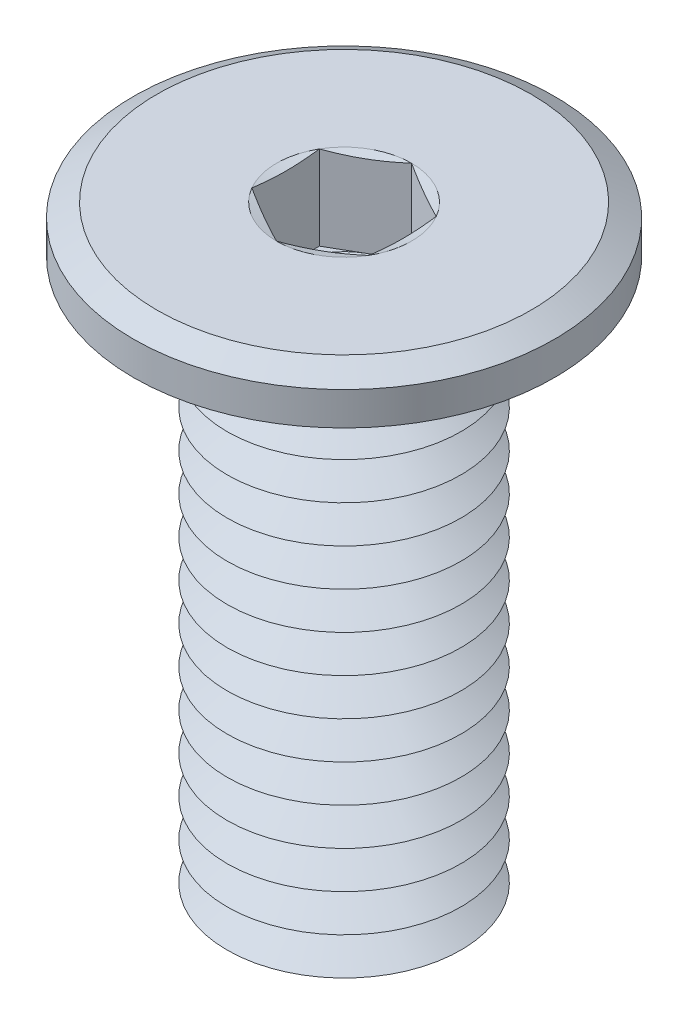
ISO-10303-21;
HEADER;
FILE_DESCRIPTION(('STEP AP214'),'2;1');
FILE_NAME('part.step','',(''),(''),'','','');
FILE_SCHEMA(('AUTOMOTIVE_DESIGN { 1 0 10303 214 1 1 1 1 }'));
ENDSEC;
DATA;
#1=APPLICATION_CONTEXT('core data for automotive mechanical design processes');
#2=APPLICATION_PROTOCOL_DEFINITION('international standard','automotive_design',2000,#1);
#3=PRODUCT_CONTEXT('',#1,'mechanical');
#4=PRODUCT('Part','Part','',(#3));
#5=PRODUCT_RELATED_PRODUCT_CATEGORY('part','',(#4));
#6=PRODUCT_DEFINITION_FORMATION('','',#4);
#7=PRODUCT_DEFINITION_CONTEXT('part definition',#1,'design');
#8=PRODUCT_DEFINITION('design','',#6,#7);
#9=PRODUCT_DEFINITION_SHAPE('','',#8);
#10=(LENGTH_UNIT() NAMED_UNIT(*) SI_UNIT(.MILLI.,.METRE.));
#11=(NAMED_UNIT(*) PLANE_ANGLE_UNIT() SI_UNIT($,.RADIAN.));
#12=(NAMED_UNIT(*) SI_UNIT($,.STERADIAN.) SOLID_ANGLE_UNIT());
#13=UNCERTAINTY_MEASURE_WITH_UNIT(LENGTH_MEASURE(1.E-05),#10,'distance_accuracy_value','');
#14=(GEOMETRIC_REPRESENTATION_CONTEXT(3) GLOBAL_UNCERTAINTY_ASSIGNED_CONTEXT((#13)) GLOBAL_UNIT_ASSIGNED_CONTEXT((#10,
#11,#12)) REPRESENTATION_CONTEXT('',''));
#15=CARTESIAN_POINT('',(0.,0.,0.));
#16=DIRECTION('',(0.,0.,1.));
#17=DIRECTION('',(1.,0.,0.));
#18=AXIS2_PLACEMENT_3D('',#15,#16,#17);
#19=CARTESIAN_POINT('',(0.,-11.8,0.));
#20=DIRECTION('',(0.,-1.,0.));
#21=DIRECTION('',(0.,0.,-1.));
#22=AXIS2_PLACEMENT_3D('',#19,#20,#21);
#23=CONICAL_SURFACE('',#22,2.5,1.0471975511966);
#24=CARTESIAN_POINT('',(0.,-11.4,0.));
#25=DIRECTION('',(0.,1.,0.));
#26=DIRECTION('',(0.,0.,1.));
#27=AXIS2_PLACEMENT_3D('',#24,#25,#26);
#28=CIRCLE('',#27,1.80717967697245);
#29=CARTESIAN_POINT('',(0.,-11.4,1.80717967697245));
#30=VERTEX_POINT('',#29);
#31=EDGE_CURVE('E465',#30,#30,#28,.T.);
#32=ORIENTED_EDGE('',*,*,#31,.F.);
#33=EDGE_LOOP('',(#32));
#34=FACE_BOUND('',#33,.T.);
#35=CARTESIAN_POINT('',(0.,-11.8,0.));
#36=DIRECTION('',(0.,1.,0.));
#37=DIRECTION('',(0.,0.,1.));
#38=AXIS2_PLACEMENT_3D('',#35,#36,#37);
#39=CIRCLE('',#38,2.5);
#40=CARTESIAN_POINT('',(0.,-11.8,2.5));
#41=VERTEX_POINT('',#40);
#42=EDGE_CURVE('E469',#41,#41,#39,.T.);
#43=ORIENTED_EDGE('',*,*,#42,.T.);
#44=EDGE_LOOP('',(#43));
#45=FACE_BOUND('',#44,.T.);
#46=ADVANCED_FACE('F39',(#34,#45),#23,.T.);
#47=CARTESIAN_POINT('',(0.,-11.4,0.));
#48=DIRECTION('',(0.,1.,0.));
#49=DIRECTION('',(0.,0.,1.));
#50=AXIS2_PLACEMENT_3D('',#47,#48,#49);
#51=CONICAL_SURFACE('',#50,1.80717967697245,1.0471975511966);
#52=CARTESIAN_POINT('',(0.,-11.,0.));
#53=DIRECTION('',(0.,1.,0.));
#54=DIRECTION('',(0.,0.,1.));
#55=AXIS2_PLACEMENT_3D('',#52,#53,#54);
#56=CIRCLE('',#55,2.5);
#57=CARTESIAN_POINT('',(0.,-11.,2.5));
#58=VERTEX_POINT('',#57);
#59=EDGE_CURVE('E461',#58,#58,#56,.T.);
#60=ORIENTED_EDGE('',*,*,#59,.F.);
#61=EDGE_LOOP('',(#60));
#62=FACE_BOUND('',#61,.T.);
#63=ORIENTED_EDGE('',*,*,#31,.T.);
#64=EDGE_LOOP('',(#63));
#65=FACE_BOUND('',#64,.T.);
#66=ADVANCED_FACE('F232',(#62,#65),#51,.T.);
#67=CARTESIAN_POINT('',(0.,-13.,0.));
#68=DIRECTION('',(0.,-1.,0.));
#69=DIRECTION('',(0.,0.,-1.));
#70=AXIS2_PLACEMENT_3D('',#67,#68,#69);
#71=PLANE('',#70);
#72=CARTESIAN_POINT('',(0.,-13.,0.));
#73=DIRECTION('',(0.,1.,0.));
#74=DIRECTION('',(0.,0.,1.));
#75=AXIS2_PLACEMENT_3D('',#72,#73,#74);
#76=CIRCLE('',#75,1.80717967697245);
#77=CARTESIAN_POINT('',(0.,-13.,1.80717967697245));
#78=VERTEX_POINT('',#77);
#79=EDGE_CURVE('E298',#78,#78,#76,.T.);
#80=ORIENTED_EDGE('',*,*,#79,.F.);
#81=EDGE_LOOP('',(#80));
#82=FACE_BOUND('',#81,.T.);
#83=ADVANCED_FACE('F238',(#82),#71,.T.);
#84=CARTESIAN_POINT('',(0.,-13.,0.));
#85=DIRECTION('',(0.,1.,0.));
#86=DIRECTION('',(0.,0.,1.));
#87=AXIS2_PLACEMENT_3D('',#84,#85,#86);
#88=CONICAL_SURFACE('',#87,1.80717967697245,1.0471975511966);
#89=CARTESIAN_POINT('',(0.,-12.6,0.));
#90=DIRECTION('',(0.,1.,0.));
#91=DIRECTION('',(0.,0.,1.));
#92=AXIS2_PLACEMENT_3D('',#89,#90,#91);
#93=CIRCLE('',#92,2.5);
#94=CARTESIAN_POINT('',(0.,-12.6,2.5));
#95=VERTEX_POINT('',#94);
#96=EDGE_CURVE('E477',#95,#95,#93,.T.);
#97=ORIENTED_EDGE('',*,*,#96,.F.);
#98=EDGE_LOOP('',(#97));
#99=FACE_BOUND('',#98,.T.);
#100=ORIENTED_EDGE('',*,*,#79,.T.);
#101=EDGE_LOOP('',(#100));
#102=FACE_BOUND('',#101,.T.);
#103=ADVANCED_FACE('F253',(#99,#102),#88,.T.);
#104=CARTESIAN_POINT('',(0.,-12.6,0.));
#105=DIRECTION('',(0.,-1.,0.));
#106=DIRECTION('',(0.,0.,-1.));
#107=AXIS2_PLACEMENT_3D('',#104,#105,#106);
#108=CONICAL_SURFACE('',#107,2.5,1.0471975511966);
#109=CARTESIAN_POINT('',(0.,-12.2,0.));
#110=DIRECTION('',(0.,1.,0.));
#111=DIRECTION('',(0.,0.,1.));
#112=AXIS2_PLACEMENT_3D('',#109,#110,#111);
#113=CIRCLE('',#112,1.80717967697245);
#114=CARTESIAN_POINT('',(0.,-12.2,1.80717967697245));
#115=VERTEX_POINT('',#114);
#116=EDGE_CURVE('E473',#115,#115,#113,.T.);
#117=ORIENTED_EDGE('',*,*,#116,.F.);
#118=EDGE_LOOP('',(#117));
#119=FACE_BOUND('',#118,.T.);
#120=ORIENTED_EDGE('',*,*,#96,.T.);
#121=EDGE_LOOP('',(#120));
#122=FACE_BOUND('',#121,.T.);
#123=ADVANCED_FACE('F249',(#119,#122),#108,.T.);
#124=CARTESIAN_POINT('',(0.,-12.2,0.));
#125=DIRECTION('',(0.,1.,0.));
#126=DIRECTION('',(0.,0.,1.));
#127=AXIS2_PLACEMENT_3D('',#124,#125,#126);
#128=CONICAL_SURFACE('',#127,1.80717967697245,1.0471975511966);
#129=ORIENTED_EDGE('',*,*,#42,.F.);
#130=EDGE_LOOP('',(#129));
#131=FACE_BOUND('',#130,.T.);
#132=ORIENTED_EDGE('',*,*,#116,.T.);
#133=EDGE_LOOP('',(#132));
#134=FACE_BOUND('',#133,.T.);
#135=ADVANCED_FACE('F245',(#131,#134),#128,.T.);
#136=CARTESIAN_POINT('',(0.,-11.,0.));
#137=DIRECTION('',(0.,-1.,0.));
#138=DIRECTION('',(0.,0.,-1.));
#139=AXIS2_PLACEMENT_3D('',#136,#137,#138);
#140=CONICAL_SURFACE('',#139,2.5,1.0471975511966);
#141=CARTESIAN_POINT('',(0.,-10.6,0.));
#142=DIRECTION('',(0.,1.,0.));
#143=DIRECTION('',(0.,0.,1.));
#144=AXIS2_PLACEMENT_3D('',#141,#142,#143);
#145=CIRCLE('',#144,1.80717967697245);
#146=CARTESIAN_POINT('',(0.,-10.6,1.80717967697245));
#147=VERTEX_POINT('',#146);
#148=EDGE_CURVE('E457',#147,#147,#145,.T.);
#149=ORIENTED_EDGE('',*,*,#148,.F.);
#150=EDGE_LOOP('',(#149));
#151=FACE_BOUND('',#150,.T.);
#152=ORIENTED_EDGE('',*,*,#59,.T.);
#153=EDGE_LOOP('',(#152));
#154=FACE_BOUND('',#153,.T.);
#155=ADVANCED_FACE('F248',(#151,#154),#140,.T.);
#156=CARTESIAN_POINT('',(0.,-10.6,0.));
#157=DIRECTION('',(0.,1.,0.));
#158=DIRECTION('',(0.,0.,1.));
#159=AXIS2_PLACEMENT_3D('',#156,#157,#158);
#160=CONICAL_SURFACE('',#159,1.80717967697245,1.0471975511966);
#161=CARTESIAN_POINT('',(0.,-10.2,0.));
#162=DIRECTION('',(0.,1.,0.));
#163=DIRECTION('',(0.,0.,1.));
#164=AXIS2_PLACEMENT_3D('',#161,#162,#163);
#165=CIRCLE('',#164,2.5);
#166=CARTESIAN_POINT('',(0.,-10.2,2.5));
#167=VERTEX_POINT('',#166);
#168=EDGE_CURVE('E453',#167,#167,#165,.T.);
#169=ORIENTED_EDGE('',*,*,#168,.F.);
#170=EDGE_LOOP('',(#169));
#171=FACE_BOUND('',#170,.T.);
#172=ORIENTED_EDGE('',*,*,#148,.T.);
#173=EDGE_LOOP('',(#172));
#174=FACE_BOUND('',#173,.T.);
#175=ADVANCED_FACE('F868',(#171,#174),#160,.T.);
#176=CARTESIAN_POINT('',(0.,-10.2,0.));
#177=DIRECTION('',(0.,-1.,0.));
#178=DIRECTION('',(0.,0.,-1.));
#179=AXIS2_PLACEMENT_3D('',#176,#177,#178);
#180=CONICAL_SURFACE('',#179,2.5,1.0471975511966);
#181=CARTESIAN_POINT('',(0.,-9.8,0.));
#182=DIRECTION('',(0.,1.,0.));
#183=DIRECTION('',(0.,0.,1.));
#184=AXIS2_PLACEMENT_3D('',#181,#182,#183);
#185=CIRCLE('',#184,1.80717967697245);
#186=CARTESIAN_POINT('',(0.,-9.8,1.80717967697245));
#187=VERTEX_POINT('',#186);
#188=EDGE_CURVE('E449',#187,#187,#185,.T.);
#189=ORIENTED_EDGE('',*,*,#188,.F.);
#190=EDGE_LOOP('',(#189));
#191=FACE_BOUND('',#190,.T.);
#192=ORIENTED_EDGE('',*,*,#168,.T.);
#193=EDGE_LOOP('',(#192));
#194=FACE_BOUND('',#193,.T.);
#195=ADVANCED_FACE('F859',(#191,#194),#180,.T.);
#196=CARTESIAN_POINT('',(0.,-9.8,0.));
#197=DIRECTION('',(0.,1.,0.));
#198=DIRECTION('',(0.,0.,1.));
#199=AXIS2_PLACEMENT_3D('',#196,#197,#198);
#200=CONICAL_SURFACE('',#199,1.80717967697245,1.0471975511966);
#201=CARTESIAN_POINT('',(0.,-9.4,0.));
#202=DIRECTION('',(0.,1.,0.));
#203=DIRECTION('',(0.,0.,1.));
#204=AXIS2_PLACEMENT_3D('',#201,#202,#203);
#205=CIRCLE('',#204,2.5);
#206=CARTESIAN_POINT('',(0.,-9.4,2.5));
#207=VERTEX_POINT('',#206);
#208=EDGE_CURVE('E445',#207,#207,#205,.T.);
#209=ORIENTED_EDGE('',*,*,#208,.F.);
#210=EDGE_LOOP('',(#209));
#211=FACE_BOUND('',#210,.T.);
#212=ORIENTED_EDGE('',*,*,#188,.T.);
#213=EDGE_LOOP('',(#212));
#214=FACE_BOUND('',#213,.T.);
#215=ADVANCED_FACE('F850',(#211,#214),#200,.T.);
#216=CARTESIAN_POINT('',(0.,-9.4,0.));
#217=DIRECTION('',(0.,-1.,0.));
#218=DIRECTION('',(0.,0.,-1.));
#219=AXIS2_PLACEMENT_3D('',#216,#217,#218);
#220=CONICAL_SURFACE('',#219,2.5,1.0471975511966);
#221=CARTESIAN_POINT('',(0.,-9.,0.));
#222=DIRECTION('',(0.,1.,0.));
#223=DIRECTION('',(0.,0.,1.));
#224=AXIS2_PLACEMENT_3D('',#221,#222,#223);
#225=CIRCLE('',#224,1.80717967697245);
#226=CARTESIAN_POINT('',(0.,-9.,1.80717967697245));
#227=VERTEX_POINT('',#226);
#228=EDGE_CURVE('E441',#227,#227,#225,.T.);
#229=ORIENTED_EDGE('',*,*,#228,.F.);
#230=EDGE_LOOP('',(#229));
#231=FACE_BOUND('',#230,.T.);
#232=ORIENTED_EDGE('',*,*,#208,.T.);
#233=EDGE_LOOP('',(#232));
#234=FACE_BOUND('',#233,.T.);
#235=ADVANCED_FACE('F841',(#231,#234),#220,.T.);
#236=CARTESIAN_POINT('',(0.,-9.,0.));
#237=DIRECTION('',(0.,1.,0.));
#238=DIRECTION('',(0.,0.,1.));
#239=AXIS2_PLACEMENT_3D('',#236,#237,#238);
#240=CONICAL_SURFACE('',#239,1.80717967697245,1.0471975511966);
#241=CARTESIAN_POINT('',(0.,-8.6,0.));
#242=DIRECTION('',(0.,1.,0.));
#243=DIRECTION('',(0.,0.,1.));
#244=AXIS2_PLACEMENT_3D('',#241,#242,#243);
#245=CIRCLE('',#244,2.5);
#246=CARTESIAN_POINT('',(0.,-8.6,2.5));
#247=VERTEX_POINT('',#246);
#248=EDGE_CURVE('E438',#247,#247,#245,.T.);
#249=ORIENTED_EDGE('',*,*,#248,.F.);
#250=EDGE_LOOP('',(#249));
#251=FACE_BOUND('',#250,.T.);
#252=ORIENTED_EDGE('',*,*,#228,.T.);
#253=EDGE_LOOP('',(#252));
#254=FACE_BOUND('',#253,.T.);
#255=ADVANCED_FACE('F832',(#251,#254),#240,.T.);
#256=CARTESIAN_POINT('',(0.,-8.6,0.));
#257=DIRECTION('',(0.,-1.,0.));
#258=DIRECTION('',(0.,0.,-1.));
#259=AXIS2_PLACEMENT_3D('',#256,#257,#258);
#260=CONICAL_SURFACE('',#259,2.5,1.0471975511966);
#261=CARTESIAN_POINT('',(0.,-8.2,0.));
#262=DIRECTION('',(0.,1.,0.));
#263=DIRECTION('',(0.,0.,1.));
#264=AXIS2_PLACEMENT_3D('',#261,#262,#263);
#265=CIRCLE('',#264,1.80717967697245);
#266=CARTESIAN_POINT('',(0.,-8.2,1.80717967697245));
#267=VERTEX_POINT('',#266);
#268=EDGE_CURVE('E434',#267,#267,#265,.T.);
#269=ORIENTED_EDGE('',*,*,#268,.F.);
#270=EDGE_LOOP('',(#269));
#271=FACE_BOUND('',#270,.T.);
#272=ORIENTED_EDGE('',*,*,#248,.T.);
#273=EDGE_LOOP('',(#272));
#274=FACE_BOUND('',#273,.T.);
#275=ADVANCED_FACE('F823',(#271,#274),#260,.T.);
#276=CARTESIAN_POINT('',(0.,-8.2,0.));
#277=DIRECTION('',(0.,1.,0.));
#278=DIRECTION('',(0.,0.,1.));
#279=AXIS2_PLACEMENT_3D('',#276,#277,#278);
#280=CONICAL_SURFACE('',#279,1.80717967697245,1.0471975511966);
#281=CARTESIAN_POINT('',(0.,-7.8,0.));
#282=DIRECTION('',(0.,1.,0.));
#283=DIRECTION('',(0.,0.,1.));
#284=AXIS2_PLACEMENT_3D('',#281,#282,#283);
#285=CIRCLE('',#284,2.5);
#286=CARTESIAN_POINT('',(0.,-7.8,2.5));
#287=VERTEX_POINT('',#286);
#288=EDGE_CURVE('E430',#287,#287,#285,.T.);
#289=ORIENTED_EDGE('',*,*,#288,.F.);
#290=EDGE_LOOP('',(#289));
#291=FACE_BOUND('',#290,.T.);
#292=ORIENTED_EDGE('',*,*,#268,.T.);
#293=EDGE_LOOP('',(#292));
#294=FACE_BOUND('',#293,.T.);
#295=ADVANCED_FACE('F814',(#291,#294),#280,.T.);
#296=CARTESIAN_POINT('',(0.,-7.8,0.));
#297=DIRECTION('',(0.,-1.,0.));
#298=DIRECTION('',(0.,0.,-1.));
#299=AXIS2_PLACEMENT_3D('',#296,#297,#298);
#300=CONICAL_SURFACE('',#299,2.5,1.0471975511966);
#301=CARTESIAN_POINT('',(0.,-7.4,0.));
#302=DIRECTION('',(0.,1.,0.));
#303=DIRECTION('',(0.,0.,1.));
#304=AXIS2_PLACEMENT_3D('',#301,#302,#303);
#305=CIRCLE('',#304,1.80717967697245);
#306=CARTESIAN_POINT('',(0.,-7.4,1.80717967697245));
#307=VERTEX_POINT('',#306);
#308=EDGE_CURVE('E426',#307,#307,#305,.T.);
#309=ORIENTED_EDGE('',*,*,#308,.F.);
#310=EDGE_LOOP('',(#309));
#311=FACE_BOUND('',#310,.T.);
#312=ORIENTED_EDGE('',*,*,#288,.T.);
#313=EDGE_LOOP('',(#312));
#314=FACE_BOUND('',#313,.T.);
#315=ADVANCED_FACE('F805',(#311,#314),#300,.T.);
#316=CARTESIAN_POINT('',(0.,-7.4,0.));
#317=DIRECTION('',(0.,1.,0.));
#318=DIRECTION('',(0.,0.,1.));
#319=AXIS2_PLACEMENT_3D('',#316,#317,#318);
#320=CONICAL_SURFACE('',#319,1.80717967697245,1.0471975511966);
#321=CARTESIAN_POINT('',(0.,-7.,0.));
#322=DIRECTION('',(0.,1.,0.));
#323=DIRECTION('',(0.,0.,1.));
#324=AXIS2_PLACEMENT_3D('',#321,#322,#323);
#325=CIRCLE('',#324,2.5);
#326=CARTESIAN_POINT('',(0.,-7.,2.5));
#327=VERTEX_POINT('',#326);
#328=EDGE_CURVE('E422',#327,#327,#325,.T.);
#329=ORIENTED_EDGE('',*,*,#328,.F.);
#330=EDGE_LOOP('',(#329));
#331=FACE_BOUND('',#330,.T.);
#332=ORIENTED_EDGE('',*,*,#308,.T.);
#333=EDGE_LOOP('',(#332));
#334=FACE_BOUND('',#333,.T.);
#335=ADVANCED_FACE('F796',(#331,#334),#320,.T.);
#336=CARTESIAN_POINT('',(0.,-7.,0.));
#337=DIRECTION('',(0.,-1.,0.));
#338=DIRECTION('',(0.,0.,-1.));
#339=AXIS2_PLACEMENT_3D('',#336,#337,#338);
#340=CONICAL_SURFACE('',#339,2.5,1.0471975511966);
#341=CARTESIAN_POINT('',(0.,-6.6,0.));
#342=DIRECTION('',(0.,1.,0.));
#343=DIRECTION('',(0.,0.,1.));
#344=AXIS2_PLACEMENT_3D('',#341,#342,#343);
#345=CIRCLE('',#344,1.80717967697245);
#346=CARTESIAN_POINT('',(0.,-6.6,1.80717967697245));
#347=VERTEX_POINT('',#346);
#348=EDGE_CURVE('E418',#347,#347,#345,.T.);
#349=ORIENTED_EDGE('',*,*,#348,.F.);
#350=EDGE_LOOP('',(#349));
#351=FACE_BOUND('',#350,.T.);
#352=ORIENTED_EDGE('',*,*,#328,.T.);
#353=EDGE_LOOP('',(#352));
#354=FACE_BOUND('',#353,.T.);
#355=ADVANCED_FACE('F787',(#351,#354),#340,.T.);
#356=CARTESIAN_POINT('',(0.,-6.6,0.));
#357=DIRECTION('',(0.,1.,0.));
#358=DIRECTION('',(0.,0.,1.));
#359=AXIS2_PLACEMENT_3D('',#356,#357,#358);
#360=CONICAL_SURFACE('',#359,1.80717967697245,1.0471975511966);
#361=CARTESIAN_POINT('',(0.,-6.2,0.));
#362=DIRECTION('',(0.,1.,0.));
#363=DIRECTION('',(0.,0.,1.));
#364=AXIS2_PLACEMENT_3D('',#361,#362,#363);
#365=CIRCLE('',#364,2.5);
#366=CARTESIAN_POINT('',(0.,-6.2,2.5));
#367=VERTEX_POINT('',#366);
#368=EDGE_CURVE('E414',#367,#367,#365,.T.);
#369=ORIENTED_EDGE('',*,*,#368,.F.);
#370=EDGE_LOOP('',(#369));
#371=FACE_BOUND('',#370,.T.);
#372=ORIENTED_EDGE('',*,*,#348,.T.);
#373=EDGE_LOOP('',(#372));
#374=FACE_BOUND('',#373,.T.);
#375=ADVANCED_FACE('F778',(#371,#374),#360,.T.);
#376=CARTESIAN_POINT('',(0.,-6.2,0.));
#377=DIRECTION('',(0.,-1.,0.));
#378=DIRECTION('',(0.,0.,-1.));
#379=AXIS2_PLACEMENT_3D('',#376,#377,#378);
#380=CONICAL_SURFACE('',#379,2.5,1.0471975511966);
#381=CARTESIAN_POINT('',(0.,-5.8,0.));
#382=DIRECTION('',(0.,1.,0.));
#383=DIRECTION('',(0.,0.,1.));
#384=AXIS2_PLACEMENT_3D('',#381,#382,#383);
#385=CIRCLE('',#384,1.80717967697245);
#386=CARTESIAN_POINT('',(0.,-5.8,1.80717967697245));
#387=VERTEX_POINT('',#386);
#388=EDGE_CURVE('E410',#387,#387,#385,.T.);
#389=ORIENTED_EDGE('',*,*,#388,.F.);
#390=EDGE_LOOP('',(#389));
#391=FACE_BOUND('',#390,.T.);
#392=ORIENTED_EDGE('',*,*,#368,.T.);
#393=EDGE_LOOP('',(#392));
#394=FACE_BOUND('',#393,.T.);
#395=ADVANCED_FACE('F769',(#391,#394),#380,.T.);
#396=CARTESIAN_POINT('',(0.,-5.8,0.));
#397=DIRECTION('',(0.,1.,0.));
#398=DIRECTION('',(0.,0.,1.));
#399=AXIS2_PLACEMENT_3D('',#396,#397,#398);
#400=CONICAL_SURFACE('',#399,1.80717967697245,1.0471975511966);
#401=CARTESIAN_POINT('',(0.,-5.4,0.));
#402=DIRECTION('',(0.,1.,0.));
#403=DIRECTION('',(0.,0.,1.));
#404=AXIS2_PLACEMENT_3D('',#401,#402,#403);
#405=CIRCLE('',#404,2.5);
#406=CARTESIAN_POINT('',(0.,-5.4,2.5));
#407=VERTEX_POINT('',#406);
#408=EDGE_CURVE('E406',#407,#407,#405,.T.);
#409=ORIENTED_EDGE('',*,*,#408,.F.);
#410=EDGE_LOOP('',(#409));
#411=FACE_BOUND('',#410,.T.);
#412=ORIENTED_EDGE('',*,*,#388,.T.);
#413=EDGE_LOOP('',(#412));
#414=FACE_BOUND('',#413,.T.);
#415=ADVANCED_FACE('F760',(#411,#414),#400,.T.);
#416=CARTESIAN_POINT('',(0.,-5.4,0.));
#417=DIRECTION('',(0.,-1.,0.));
#418=DIRECTION('',(0.,0.,-1.));
#419=AXIS2_PLACEMENT_3D('',#416,#417,#418);
#420=CONICAL_SURFACE('',#419,2.5,1.0471975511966);
#421=CARTESIAN_POINT('',(0.,-5.,0.));
#422=DIRECTION('',(0.,1.,0.));
#423=DIRECTION('',(0.,0.,1.));
#424=AXIS2_PLACEMENT_3D('',#421,#422,#423);
#425=CIRCLE('',#424,1.80717967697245);
#426=CARTESIAN_POINT('',(0.,-5.,1.80717967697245));
#427=VERTEX_POINT('',#426);
#428=EDGE_CURVE('E402',#427,#427,#425,.T.);
#429=ORIENTED_EDGE('',*,*,#428,.F.);
#430=EDGE_LOOP('',(#429));
#431=FACE_BOUND('',#430,.T.);
#432=ORIENTED_EDGE('',*,*,#408,.T.);
#433=EDGE_LOOP('',(#432));
#434=FACE_BOUND('',#433,.T.);
#435=ADVANCED_FACE('F751',(#431,#434),#420,.T.);
#436=CARTESIAN_POINT('',(0.,-5.,0.));
#437=DIRECTION('',(0.,1.,0.));
#438=DIRECTION('',(0.,0.,1.));
#439=AXIS2_PLACEMENT_3D('',#436,#437,#438);
#440=CONICAL_SURFACE('',#439,1.80717967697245,1.0471975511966);
#441=CARTESIAN_POINT('',(0.,-4.6,0.));
#442=DIRECTION('',(0.,1.,0.));
#443=DIRECTION('',(0.,0.,1.));
#444=AXIS2_PLACEMENT_3D('',#441,#442,#443);
#445=CIRCLE('',#444,2.5);
#446=CARTESIAN_POINT('',(0.,-4.6,2.5));
#447=VERTEX_POINT('',#446);
#448=EDGE_CURVE('E398',#447,#447,#445,.T.);
#449=ORIENTED_EDGE('',*,*,#448,.F.);
#450=EDGE_LOOP('',(#449));
#451=FACE_BOUND('',#450,.T.);
#452=ORIENTED_EDGE('',*,*,#428,.T.);
#453=EDGE_LOOP('',(#452));
#454=FACE_BOUND('',#453,.T.);
#455=ADVANCED_FACE('F742',(#451,#454),#440,.T.);
#456=CARTESIAN_POINT('',(0.,-4.6,0.));
#457=DIRECTION('',(0.,-1.,0.));
#458=DIRECTION('',(0.,0.,-1.));
#459=AXIS2_PLACEMENT_3D('',#456,#457,#458);
#460=CONICAL_SURFACE('',#459,2.5,1.0471975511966);
#461=CARTESIAN_POINT('',(0.,-4.2,0.));
#462=DIRECTION('',(0.,1.,0.));
#463=DIRECTION('',(0.,0.,1.));
#464=AXIS2_PLACEMENT_3D('',#461,#462,#463);
#465=CIRCLE('',#464,1.80717967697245);
#466=CARTESIAN_POINT('',(0.,-4.2,1.80717967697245));
#467=VERTEX_POINT('',#466);
#468=EDGE_CURVE('E394',#467,#467,#465,.T.);
#469=ORIENTED_EDGE('',*,*,#468,.F.);
#470=EDGE_LOOP('',(#469));
#471=FACE_BOUND('',#470,.T.);
#472=ORIENTED_EDGE('',*,*,#448,.T.);
#473=EDGE_LOOP('',(#472));
#474=FACE_BOUND('',#473,.T.);
#475=ADVANCED_FACE('F733',(#471,#474),#460,.T.);
#476=CARTESIAN_POINT('',(0.,-4.2,0.));
#477=DIRECTION('',(0.,1.,0.));
#478=DIRECTION('',(0.,0.,1.));
#479=AXIS2_PLACEMENT_3D('',#476,#477,#478);
#480=CONICAL_SURFACE('',#479,1.80717967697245,1.0471975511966);
#481=CARTESIAN_POINT('',(0.,-3.8,0.));
#482=DIRECTION('',(0.,1.,0.));
#483=DIRECTION('',(0.,0.,1.));
#484=AXIS2_PLACEMENT_3D('',#481,#482,#483);
#485=CIRCLE('',#484,2.5);
#486=CARTESIAN_POINT('',(0.,-3.8,2.5));
#487=VERTEX_POINT('',#486);
#488=EDGE_CURVE('E390',#487,#487,#485,.T.);
#489=ORIENTED_EDGE('',*,*,#488,.F.);
#490=EDGE_LOOP('',(#489));
#491=FACE_BOUND('',#490,.T.);
#492=ORIENTED_EDGE('',*,*,#468,.T.);
#493=EDGE_LOOP('',(#492));
#494=FACE_BOUND('',#493,.T.);
#495=ADVANCED_FACE('F724',(#491,#494),#480,.T.);
#496=CARTESIAN_POINT('',(0.,-3.8,0.));
#497=DIRECTION('',(0.,-1.,0.));
#498=DIRECTION('',(0.,0.,-1.));
#499=AXIS2_PLACEMENT_3D('',#496,#497,#498);
#500=CONICAL_SURFACE('',#499,2.5,1.0471975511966);
#501=CARTESIAN_POINT('',(0.,-3.4,0.));
#502=DIRECTION('',(0.,1.,0.));
#503=DIRECTION('',(0.,0.,1.));
#504=AXIS2_PLACEMENT_3D('',#501,#502,#503);
#505=CIRCLE('',#504,1.80717967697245);
#506=CARTESIAN_POINT('',(0.,-3.4,1.80717967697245));
#507=VERTEX_POINT('',#506);
#508=EDGE_CURVE('E386',#507,#507,#505,.T.);
#509=ORIENTED_EDGE('',*,*,#508,.F.);
#510=EDGE_LOOP('',(#509));
#511=FACE_BOUND('',#510,.T.);
#512=ORIENTED_EDGE('',*,*,#488,.T.);
#513=EDGE_LOOP('',(#512));
#514=FACE_BOUND('',#513,.T.);
#515=ADVANCED_FACE('F715',(#511,#514),#500,.T.);
#516=CARTESIAN_POINT('',(0.,-3.4,0.));
#517=DIRECTION('',(0.,1.,0.));
#518=DIRECTION('',(0.,0.,1.));
#519=AXIS2_PLACEMENT_3D('',#516,#517,#518);
#520=CONICAL_SURFACE('',#519,1.80717967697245,1.0471975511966);
#521=CARTESIAN_POINT('',(0.,-3.,0.));
#522=DIRECTION('',(0.,1.,0.));
#523=DIRECTION('',(0.,0.,1.));
#524=AXIS2_PLACEMENT_3D('',#521,#522,#523);
#525=CIRCLE('',#524,2.5);
#526=CARTESIAN_POINT('',(0.,-3.,2.5));
#527=VERTEX_POINT('',#526);
#528=EDGE_CURVE('E382',#527,#527,#525,.T.);
#529=ORIENTED_EDGE('',*,*,#528,.F.);
#530=EDGE_LOOP('',(#529));
#531=FACE_BOUND('',#530,.T.);
#532=ORIENTED_EDGE('',*,*,#508,.T.);
#533=EDGE_LOOP('',(#532));
#534=FACE_BOUND('',#533,.T.);
#535=ADVANCED_FACE('F706',(#531,#534),#520,.T.);
#536=CARTESIAN_POINT('',(0.,-3.,0.));
#537=DIRECTION('',(0.,-1.,0.));
#538=DIRECTION('',(0.,0.,-1.));
#539=AXIS2_PLACEMENT_3D('',#536,#537,#538);
#540=CONICAL_SURFACE('',#539,2.5,1.0471975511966);
#541=CARTESIAN_POINT('',(0.,-2.6,0.));
#542=DIRECTION('',(0.,1.,0.));
#543=DIRECTION('',(0.,0.,1.));
#544=AXIS2_PLACEMENT_3D('',#541,#542,#543);
#545=CIRCLE('',#544,1.80717967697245);
#546=CARTESIAN_POINT('',(0.,-2.6,1.80717967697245));
#547=VERTEX_POINT('',#546);
#548=EDGE_CURVE('E378',#547,#547,#545,.T.);
#549=ORIENTED_EDGE('',*,*,#548,.F.);
#550=EDGE_LOOP('',(#549));
#551=FACE_BOUND('',#550,.T.);
#552=ORIENTED_EDGE('',*,*,#528,.T.);
#553=EDGE_LOOP('',(#552));
#554=FACE_BOUND('',#553,.T.);
#555=ADVANCED_FACE('F697',(#551,#554),#540,.T.);
#556=CARTESIAN_POINT('',(0.,-2.6,0.));
#557=DIRECTION('',(0.,1.,0.));
#558=DIRECTION('',(0.,0.,1.));
#559=AXIS2_PLACEMENT_3D('',#556,#557,#558);
#560=CONICAL_SURFACE('',#559,1.80717967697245,1.0471975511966);
#561=CARTESIAN_POINT('',(0.,-2.2,0.));
#562=DIRECTION('',(0.,1.,0.));
#563=DIRECTION('',(0.,0.,1.));
#564=AXIS2_PLACEMENT_3D('',#561,#562,#563);
#565=CIRCLE('',#564,2.5);
#566=CARTESIAN_POINT('',(0.,-2.2,2.5));
#567=VERTEX_POINT('',#566);
#568=EDGE_CURVE('E362',#567,#567,#565,.T.);
#569=ORIENTED_EDGE('',*,*,#568,.F.);
#570=EDGE_LOOP('',(#569));
#571=FACE_BOUND('',#570,.T.);
#572=ORIENTED_EDGE('',*,*,#548,.T.);
#573=EDGE_LOOP('',(#572));
#574=FACE_BOUND('',#573,.T.);
#575=ADVANCED_FACE('F273',(#571,#574),#560,.T.);
#576=CARTESIAN_POINT('',(0.,0.,0.));
#577=DIRECTION('',(0.,1.,0.));
#578=DIRECTION('',(0.,0.,1.));
#579=AXIS2_PLACEMENT_3D('',#576,#577,#578);
#580=PLANE('',#579);
#581=CARTESIAN_POINT('',(0.,0.,0.));
#582=DIRECTION('',(0.,1.,0.));
#583=DIRECTION('',(0.,0.,1.));
#584=AXIS2_PLACEMENT_3D('',#581,#582,#583);
#585=CIRCLE('',#584,1.44337567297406);
#586=CARTESIAN_POINT('',(0.,0.,1.44337567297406));
#587=VERTEX_POINT('',#586);
#588=CARTESIAN_POINT('',(1.25,0.,0.721687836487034));
#589=VERTEX_POINT('',#588);
#590=EDGE_CURVE('E66',#587,#589,#585,.T.);
#591=ORIENTED_EDGE('',*,*,#590,.F.);
#592=CARTESIAN_POINT('',(-1.25,0.,0.721687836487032));
#593=VERTEX_POINT('',#592);
#594=EDGE_CURVE('E168',#593,#587,#585,.T.);
#595=ORIENTED_EDGE('',*,*,#594,.F.);
#596=CARTESIAN_POINT('',(-1.25,0.,-0.721687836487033));
#597=VERTEX_POINT('',#596);
#598=EDGE_CURVE('E164',#597,#593,#585,.T.);
#599=ORIENTED_EDGE('',*,*,#598,.F.);
#600=CARTESIAN_POINT('',(0.,0.,-1.44337567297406));
#601=VERTEX_POINT('',#600);
#602=EDGE_CURVE('E128',#601,#597,#585,.T.);
#603=ORIENTED_EDGE('',*,*,#602,.F.);
#604=CARTESIAN_POINT('',(1.25,0.,-0.721687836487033));
#605=VERTEX_POINT('',#604);
#606=EDGE_CURVE('E119',#605,#601,#585,.T.);
#607=ORIENTED_EDGE('',*,*,#606,.F.);
#608=EDGE_CURVE('E59',#589,#605,#585,.T.);
#609=ORIENTED_EDGE('',*,*,#608,.F.);
#610=EDGE_LOOP('',(#591,#595,#599,#603,#607,#609));
#611=FACE_BOUND('',#610,.T.);
#612=CARTESIAN_POINT('',(0.,0.,0.));
#613=DIRECTION('',(0.,1.,0.));
#614=DIRECTION('',(0.,0.,1.));
#615=AXIS2_PLACEMENT_3D('',#612,#613,#614);
#616=CIRCLE('',#615,4.);
#617=CARTESIAN_POINT('',(0.,0.,4.));
#618=VERTEX_POINT('',#617);
#619=EDGE_CURVE('E294',#618,#618,#616,.T.);
#620=ORIENTED_EDGE('',*,*,#619,.T.);
#621=EDGE_LOOP('',(#620));
#622=FACE_BOUND('',#621,.T.);
#623=ADVANCED_FACE('F160',(#611,#622),#580,.T.);
#624=CARTESIAN_POINT('',(0.,-1.,0.));
#625=DIRECTION('',(0.,1.,0.));
#626=DIRECTION('',(0.,0.,1.));
#627=AXIS2_PLACEMENT_3D('',#624,#625,#626);
#628=CYLINDRICAL_SURFACE('',#627,4.5);
#629=CARTESIAN_POINT('',(0.,-0.288675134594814,0.));
#630=DIRECTION('',(0.,1.,0.));
#631=DIRECTION('',(0.,0.,1.));
#632=AXIS2_PLACEMENT_3D('',#629,#630,#631);
#633=CIRCLE('',#632,4.5);
#634=CARTESIAN_POINT('',(0.,-0.288675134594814,4.5));
#635=VERTEX_POINT('',#634);
#636=EDGE_CURVE('E305',#635,#635,#633,.F.);
#637=ORIENTED_EDGE('',*,*,#636,.T.);
#638=EDGE_LOOP('',(#637));
#639=FACE_BOUND('',#638,.T.);
#640=CARTESIAN_POINT('',(0.,-1.,0.));
#641=DIRECTION('',(0.,1.,0.));
#642=DIRECTION('',(0.,0.,1.));
#643=AXIS2_PLACEMENT_3D('',#640,#641,#642);
#644=CIRCLE('',#643,4.5);
#645=CARTESIAN_POINT('',(0.,-1.,4.5));
#646=VERTEX_POINT('',#645);
#647=EDGE_CURVE('E290',#646,#646,#644,.T.);
#648=ORIENTED_EDGE('',*,*,#647,.T.);
#649=EDGE_LOOP('',(#648));
#650=FACE_BOUND('',#649,.T.);
#651=ADVANCED_FACE('F269',(#639,#650),#628,.T.);
#652=CARTESIAN_POINT('',(0.,-1.,0.));
#653=DIRECTION('',(0.,1.,0.));
#654=DIRECTION('',(0.,0.,1.));
#655=AXIS2_PLACEMENT_3D('',#652,#653,#654);
#656=PLANE('',#655);
#657=CARTESIAN_POINT('',(0.,-1.,0.));
#658=DIRECTION('',(0.,1.,0.));
#659=DIRECTION('',(0.,0.,1.));
#660=AXIS2_PLACEMENT_3D('',#657,#658,#659);
#661=CIRCLE('',#660,2.7);
#662=CARTESIAN_POINT('',(0.,-1.,2.7));
#663=VERTEX_POINT('',#662);
#664=EDGE_CURVE('E285',#663,#663,#661,.T.);
#665=ORIENTED_EDGE('',*,*,#664,.T.);
#666=EDGE_LOOP('',(#665));
#667=FACE_BOUND('',#666,.T.);
#668=ORIENTED_EDGE('',*,*,#647,.F.);
#669=EDGE_LOOP('',(#668));
#670=FACE_BOUND('',#669,.T.);
#671=ADVANCED_FACE('F265',(#667,#670),#656,.F.);
#672=CARTESIAN_POINT('',(0.,-13.,0.));
#673=DIRECTION('',(0.,1.,0.));
#674=DIRECTION('',(0.,0.,1.));
#675=AXIS2_PLACEMENT_3D('',#672,#673,#674);
#676=CYLINDRICAL_SURFACE('',#675,2.5);
#677=CARTESIAN_POINT('',(0.,-1.2,0.));
#678=DIRECTION('',(0.,1.,0.));
#679=DIRECTION('',(0.,0.,1.));
#680=AXIS2_PLACEMENT_3D('',#677,#678,#679);
#681=CIRCLE('',#680,2.5);
#682=CARTESIAN_POINT('',(0.,-1.2,2.5));
#683=VERTEX_POINT('',#682);
#684=EDGE_CURVE('E288',#683,#683,#681,.F.);
#685=ORIENTED_EDGE('',*,*,#684,.T.);
#686=EDGE_LOOP('',(#685));
#687=FACE_BOUND('',#686,.T.);
#688=ORIENTED_EDGE('',*,*,#568,.T.);
#689=EDGE_LOOP('',(#688));
#690=FACE_BOUND('',#689,.T.);
#691=ADVANCED_FACE('F261',(#687,#690),#676,.T.);
#692=CARTESIAN_POINT('',(0.,-1.2,0.));
#693=DIRECTION('',(0.,1.,0.));
#694=DIRECTION('',(0.,0.,1.));
#695=AXIS2_PLACEMENT_3D('',#692,#693,#694);
#696=TOROIDAL_SURFACE('',#695,2.7,0.2);
#697=ORIENTED_EDGE('',*,*,#664,.F.);
#698=EDGE_LOOP('',(#697));
#699=FACE_BOUND('',#698,.T.);
#700=ORIENTED_EDGE('',*,*,#684,.F.);
#701=EDGE_LOOP('',(#700));
#702=FACE_BOUND('',#701,.T.);
#703=ADVANCED_FACE('F264',(#699,#702),#696,.F.);
#704=CARTESIAN_POINT('',(0.,0.,0.));
#705=DIRECTION('',(0.,-1.,0.));
#706=DIRECTION('',(0.,0.,-1.));
#707=AXIS2_PLACEMENT_3D('',#704,#705,#706);
#708=CONICAL_SURFACE('',#707,4.,1.0471975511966);
#709=ORIENTED_EDGE('',*,*,#636,.F.);
#710=EDGE_LOOP('',(#709));
#711=FACE_BOUND('',#710,.T.);
#712=ORIENTED_EDGE('',*,*,#619,.F.);
#713=EDGE_LOOP('',(#712));
#714=FACE_BOUND('',#713,.T.);
#715=ADVANCED_FACE('F41',(#711,#714),#708,.T.);
#716=CARTESIAN_POINT('',(0.,0.,0.));
#717=DIRECTION('',(0.,1.,0.));
#718=DIRECTION('',(0.,0.,1.));
#719=AXIS2_PLACEMENT_3D('',#716,#717,#718);
#720=CONICAL_SURFACE('',#719,1.44337567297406,1.30899693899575);
#721=ORIENTED_EDGE('',*,*,#602,.T.);
#722=CARTESIAN_POINT('',(0.000200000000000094,3.09438201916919E-05,-1.4434911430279));
#723=CARTESIAN_POINT('',(-0.0517259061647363,-0.00800698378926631,-1.41351170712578));
#724=CARTESIAN_POINT('',(-0.103745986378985,-0.0153042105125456,-1.38347789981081));
#725=CARTESIAN_POINT('',(-0.207969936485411,-0.028124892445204,-1.32330417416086));
#726=CARTESIAN_POINT('',(-0.260173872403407,-0.0336476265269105,-1.29316421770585));
#727=CARTESIAN_POINT('',(-0.36444888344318,-0.0425967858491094,-1.23296101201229));
#728=CARTESIAN_POINT('',(-0.416519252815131,-0.0460338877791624,-1.20289817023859));
#729=CARTESIAN_POINT('',(-0.520726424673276,-0.0506427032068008,-1.1427341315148));
#730=CARTESIAN_POINT('',(-0.572863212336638,-0.0518148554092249,-1.11263294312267));
#731=CARTESIAN_POINT('',(-0.677136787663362,-0.0518148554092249,-1.05243056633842));
#732=CARTESIAN_POINT('',(-0.729273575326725,-0.0506427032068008,-1.0223293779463));
#733=CARTESIAN_POINT('',(-0.833480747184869,-0.0460338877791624,-0.96216533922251));
#734=CARTESIAN_POINT('',(-0.88555111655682,-0.0425967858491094,-0.932102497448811));
#735=CARTESIAN_POINT('',(-0.989826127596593,-0.0336476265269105,-0.871899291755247));
#736=CARTESIAN_POINT('',(-1.04203006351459,-0.028124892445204,-0.841759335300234));
#737=CARTESIAN_POINT('',(-1.14625401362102,-0.0153042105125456,-0.781585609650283));
#738=CARTESIAN_POINT('',(-1.19827409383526,-0.0080069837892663,-0.75155180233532));
#739=CARTESIAN_POINT('',(-1.2502,3.09438201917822E-05,-0.721572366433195));
#740=B_SPLINE_CURVE_WITH_KNOTS('',3,(#722,#723,#724,#725,#726,#727,#728,#729,#730,#731,#732,
#733,#734,#735,#736,#737,#738,#739),.UNSPECIFIED.,.F.,.F.,(4,2,2,2,2,2,2,2,4),(0.,
0.18149525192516,0.363064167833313,0.543695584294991,0.724292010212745,0.9048884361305,
1.08551985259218,1.26708876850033,1.44858402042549),.UNSPECIFIED.);
#741=EDGE_CURVE('E11',#601,#597,#740,.T.);
#742=ORIENTED_EDGE('',*,*,#741,.F.);
#743=EDGE_LOOP('',(#721,#742));
#744=FACE_BOUND('',#743,.T.);
#745=ADVANCED_FACE('F132',(#744),#720,.F.);
#746=ORIENTED_EDGE('',*,*,#598,.T.);
#747=CARTESIAN_POINT('',(-1.25,0.295017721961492,-2.21618029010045));
#748=CARTESIAN_POINT('',(-1.25,0.270123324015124,-2.10936606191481));
#749=CARTESIAN_POINT('',(-1.25,0.245578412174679,-2.00246488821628));
#750=CARTESIAN_POINT('',(-1.25,0.197670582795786,-1.78837821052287));
#751=CARTESIAN_POINT('',(-1.25,0.174307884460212,-1.68119265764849));
#752=CARTESIAN_POINT('',(-1.25,0.129037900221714,-1.46542158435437));
#753=CARTESIAN_POINT('',(-1.25,0.107146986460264,-1.35683258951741));
#754=CARTESIAN_POINT('',(-1.25,0.0659326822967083,-1.13914880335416));
#755=CARTESIAN_POINT('',(-1.25,0.0466095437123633,-1.03005396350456));
#756=CARTESIAN_POINT('',(-1.25,0.0123179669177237,-0.814238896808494));
#757=CARTESIAN_POINT('',(-1.25,-0.00275558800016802,-0.707535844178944));
#758=CARTESIAN_POINT('',(-1.25,-0.0275791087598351,-0.493517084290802));
#759=CARTESIAN_POINT('',(-1.25,-0.0373307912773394,-0.386201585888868));
#760=CARTESIAN_POINT('',(-1.25,-0.0498256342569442,-0.171630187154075));
#761=CARTESIAN_POINT('',(-1.25,-0.052600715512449,-0.064376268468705));
#762=CARTESIAN_POINT('',(-1.25,-0.0506356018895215,0.15006745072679));
#763=CARTESIAN_POINT('',(-1.25,-0.0458948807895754,0.257257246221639));
#764=CARTESIAN_POINT('',(-1.25,-0.032096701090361,0.441548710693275));
#765=CARTESIAN_POINT('',(-1.25,-0.0245948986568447,0.518776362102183));
#766=CARTESIAN_POINT('',(-1.25,-0.00682363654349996,0.672906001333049));
#767=CARTESIAN_POINT('',(-1.25,0.003445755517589,0.749807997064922));
#768=CARTESIAN_POINT('',(-1.25,0.0261652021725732,0.903544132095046));
#769=CARTESIAN_POINT('',(-1.25,0.0386223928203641,0.980377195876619));
#770=CARTESIAN_POINT('',(-1.25,0.0651615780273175,1.13376313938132));
#771=CARTESIAN_POINT('',(-1.25,0.0792436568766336,1.21031600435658));
#772=CARTESIAN_POINT('',(-1.25,0.108934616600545,1.36480056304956));
#773=CARTESIAN_POINT('',(-1.25,0.124569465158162,1.44272722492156));
#774=CARTESIAN_POINT('',(-1.25,0.156788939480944,1.59838383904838));
#775=CARTESIAN_POINT('',(-1.25,0.173373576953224,1.67611378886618));
#776=CARTESIAN_POINT('',(-1.25,0.2071623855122,1.83097242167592));
#777=CARTESIAN_POINT('',(-1.25,0.224362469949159,1.90810200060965));
#778=CARTESIAN_POINT('',(-1.25,0.259314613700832,2.06223034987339));
#779=CARTESIAN_POINT('',(-1.25,0.277066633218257,2.13922912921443));
#780=CARTESIAN_POINT('',(-1.25,0.295017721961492,2.21618029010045));
#781=B_SPLINE_CURVE_WITH_KNOTS('',3,(#747,#748,#749,#750,#751,#752,#753,#754,#755,#756,#757,
#758,#759,#760,#761,#762,#763,#764,#765,#766,#767,#768,#769,#770,#771,#772,#773,#774,#775,#776,
#777,#778,#779,#780),.UNSPECIFIED.,.F.,.F.,(4,2,2,2,2,2,2,2,2,2,2,2,2,2,2,2,4),(0.,
0.329038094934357,0.658136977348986,0.990437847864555,1.32277128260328,1.64596801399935,
1.96906043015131,2.29067185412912,2.61230579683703,2.84502466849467,3.07773785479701,
3.31122468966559,3.54472364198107,3.78315484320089,4.0215889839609,4.2586591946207,
4.49571235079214),.UNSPECIFIED.);
#782=EDGE_CURVE('E171',#597,#593,#781,.T.);
#783=ORIENTED_EDGE('',*,*,#782,.F.);
#784=EDGE_LOOP('',(#746,#783));
#785=FACE_BOUND('',#784,.T.);
#786=ADVANCED_FACE('F626',(#785),#720,.F.);
#787=ORIENTED_EDGE('',*,*,#594,.T.);
#788=CARTESIAN_POINT('',(-1.2502,3.09438201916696E-05,0.721572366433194));
#789=CARTESIAN_POINT('',(-1.19827409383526,-0.00800698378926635,0.75155180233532));
#790=CARTESIAN_POINT('',(-1.14625401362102,-0.0153042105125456,0.781585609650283));
#791=CARTESIAN_POINT('',(-1.04203006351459,-0.0281248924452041,0.841759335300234));
#792=CARTESIAN_POINT('',(-0.989826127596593,-0.0336476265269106,0.871899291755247));
#793=CARTESIAN_POINT('',(-0.88555111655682,-0.0425967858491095,0.932102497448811));
#794=CARTESIAN_POINT('',(-0.833480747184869,-0.0460338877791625,0.96216533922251));
#795=CARTESIAN_POINT('',(-0.729273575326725,-0.0506427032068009,1.0223293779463));
#796=CARTESIAN_POINT('',(-0.677136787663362,-0.051814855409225,1.05243056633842));
#797=CARTESIAN_POINT('',(-0.572863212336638,-0.051814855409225,1.11263294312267));
#798=CARTESIAN_POINT('',(-0.520726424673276,-0.0506427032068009,1.1427341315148));
#799=CARTESIAN_POINT('',(-0.416519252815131,-0.0460338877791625,1.20289817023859));
#800=CARTESIAN_POINT('',(-0.36444888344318,-0.0425967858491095,1.23296101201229));
#801=CARTESIAN_POINT('',(-0.260173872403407,-0.0336476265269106,1.29316421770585));
#802=CARTESIAN_POINT('',(-0.207969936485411,-0.0281248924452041,1.32330417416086));
#803=CARTESIAN_POINT('',(-0.103745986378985,-0.0153042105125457,1.38347789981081));
#804=CARTESIAN_POINT('',(-0.0517259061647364,-0.00800698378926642,1.41351170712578));
#805=CARTESIAN_POINT('',(0.000199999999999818,3.09438201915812E-05,1.4434911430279));
#806=B_SPLINE_CURVE_WITH_KNOTS('',3,(#788,#789,#790,#791,#792,#793,#794,#795,#796,#797,#798,
#799,#800,#801,#802,#803,#804,#805),.UNSPECIFIED.,.F.,.F.,(4,2,2,2,2,2,2,2,4),(0.,
0.18149525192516,0.363064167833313,0.543695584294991,0.724292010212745,0.9048884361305,
1.08551985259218,1.26708876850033,1.44858402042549),.UNSPECIFIED.);
#807=EDGE_CURVE('E179',#593,#587,#806,.T.);
#808=ORIENTED_EDGE('',*,*,#807,.F.);
#809=EDGE_LOOP('',(#787,#808));
#810=FACE_BOUND('',#809,.T.);
#811=ADVANCED_FACE('F519',(#810),#720,.F.);
#812=ORIENTED_EDGE('',*,*,#590,.T.);
#813=CARTESIAN_POINT('',(-0.000200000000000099,3.09438201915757E-05,1.4434911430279));
#814=CARTESIAN_POINT('',(0.0517259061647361,-0.00800698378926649,1.41351170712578));
#815=CARTESIAN_POINT('',(0.103745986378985,-0.0153042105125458,1.38347789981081));
#816=CARTESIAN_POINT('',(0.207969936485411,-0.0281248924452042,1.32330417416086));
#817=CARTESIAN_POINT('',(0.260173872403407,-0.0336476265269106,1.29316421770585));
#818=CARTESIAN_POINT('',(0.36444888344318,-0.0425967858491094,1.23296101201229));
#819=CARTESIAN_POINT('',(0.416519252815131,-0.0460338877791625,1.20289817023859));
#820=CARTESIAN_POINT('',(0.520726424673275,-0.0506427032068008,1.1427341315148));
#821=CARTESIAN_POINT('',(0.572863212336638,-0.0518148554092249,1.11263294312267));
#822=CARTESIAN_POINT('',(0.677136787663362,-0.0518148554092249,1.05243056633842));
#823=CARTESIAN_POINT('',(0.729273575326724,-0.0506427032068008,1.0223293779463));
#824=CARTESIAN_POINT('',(0.833480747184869,-0.0460338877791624,0.96216533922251));
#825=CARTESIAN_POINT('',(0.88555111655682,-0.0425967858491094,0.932102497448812));
#826=CARTESIAN_POINT('',(0.989826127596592,-0.0336476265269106,0.871899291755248));
#827=CARTESIAN_POINT('',(1.04203006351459,-0.0281248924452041,0.841759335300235));
#828=CARTESIAN_POINT('',(1.14625401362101,-0.0153042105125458,0.781585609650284));
#829=CARTESIAN_POINT('',(1.19827409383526,-0.00800698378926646,0.751551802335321));
#830=CARTESIAN_POINT('',(1.2502,3.09438201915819E-05,0.721572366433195));
#831=B_SPLINE_CURVE_WITH_KNOTS('',3,(#813,#814,#815,#816,#817,#818,#819,#820,#821,#822,#823,
#824,#825,#826,#827,#828,#829,#830),.UNSPECIFIED.,.F.,.F.,(4,2,2,2,2,2,2,2,4),(0.,
0.18149525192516,0.363064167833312,0.543695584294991,0.724292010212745,0.904888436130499,
1.08551985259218,1.26708876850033,1.44858402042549),.UNSPECIFIED.);
#832=EDGE_CURVE('E198',#587,#589,#831,.T.);
#833=ORIENTED_EDGE('',*,*,#832,.F.);
#834=EDGE_LOOP('',(#812,#833));
#835=FACE_BOUND('',#834,.T.);
#836=ADVANCED_FACE('F521',(#835),#720,.F.);
#837=ORIENTED_EDGE('',*,*,#608,.T.);
#838=CARTESIAN_POINT('',(1.25,0.295017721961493,2.21618029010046));
#839=CARTESIAN_POINT('',(1.25,0.270123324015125,2.10936606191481));
#840=CARTESIAN_POINT('',(1.25,0.245578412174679,2.00246488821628));
#841=CARTESIAN_POINT('',(1.25,0.197670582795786,1.78837821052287));
#842=CARTESIAN_POINT('',(1.25,0.174307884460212,1.6811926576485));
#843=CARTESIAN_POINT('',(1.25,0.129037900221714,1.46542158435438));
#844=CARTESIAN_POINT('',(1.25,0.107146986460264,1.35683258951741));
#845=CARTESIAN_POINT('',(1.25,0.0659326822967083,1.13914880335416));
#846=CARTESIAN_POINT('',(1.25,0.0466095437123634,1.03005396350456));
#847=CARTESIAN_POINT('',(1.25,0.0123179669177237,0.814238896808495));
#848=CARTESIAN_POINT('',(1.25,-0.00275558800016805,0.707535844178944));
#849=CARTESIAN_POINT('',(1.25,-0.0275791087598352,0.493517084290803));
#850=CARTESIAN_POINT('',(1.25,-0.0373307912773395,0.386201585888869));
#851=CARTESIAN_POINT('',(1.25,-0.0498256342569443,0.171630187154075));
#852=CARTESIAN_POINT('',(1.25,-0.0526007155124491,0.0643762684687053));
#853=CARTESIAN_POINT('',(1.25,-0.0506356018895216,-0.15006745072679));
#854=CARTESIAN_POINT('',(1.25,-0.0458948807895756,-0.257257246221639));
#855=CARTESIAN_POINT('',(1.25,-0.0320967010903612,-0.441548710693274));
#856=CARTESIAN_POINT('',(1.25,-0.0245948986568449,-0.518776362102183));
#857=CARTESIAN_POINT('',(1.25,-0.00682363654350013,-0.672906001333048));
#858=CARTESIAN_POINT('',(1.25,0.00344575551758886,-0.749807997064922));
#859=CARTESIAN_POINT('',(1.25,0.0261652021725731,-0.903544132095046));
#860=CARTESIAN_POINT('',(1.25,0.038622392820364,-0.980377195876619));
#861=CARTESIAN_POINT('',(1.25,0.0651615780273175,-1.13376313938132));
#862=CARTESIAN_POINT('',(1.25,0.0792436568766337,-1.21031600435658));
#863=CARTESIAN_POINT('',(1.25,0.108934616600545,-1.36480056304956));
#864=CARTESIAN_POINT('',(1.25,0.124569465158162,-1.44272722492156));
#865=CARTESIAN_POINT('',(1.25,0.156788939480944,-1.59838383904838));
#866=CARTESIAN_POINT('',(1.25,0.173373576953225,-1.67611378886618));
#867=CARTESIAN_POINT('',(1.25,0.2071623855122,-1.83097242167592));
#868=CARTESIAN_POINT('',(1.25,0.224362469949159,-1.90810200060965));
#869=CARTESIAN_POINT('',(1.25,0.259314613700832,-2.0622303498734));
#870=CARTESIAN_POINT('',(1.25,0.277066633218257,-2.13922912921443));
#871=CARTESIAN_POINT('',(1.25,0.295017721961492,-2.21618029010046));
#872=B_SPLINE_CURVE_WITH_KNOTS('',3,(#838,#839,#840,#841,#842,#843,#844,#845,#846,#847,#848,
#849,#850,#851,#852,#853,#854,#855,#856,#857,#858,#859,#860,#861,#862,#863,#864,#865,#866,#867,
#868,#869,#870,#871),.UNSPECIFIED.,.F.,.F.,(4,2,2,2,2,2,2,2,2,2,2,2,2,2,2,2,4),(0.,
0.329038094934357,0.658136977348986,0.990437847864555,1.32277128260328,1.64596801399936,
1.96906043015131,2.29067185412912,2.61230579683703,2.84502466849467,3.07773785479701,
3.3112246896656,3.54472364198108,3.78315484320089,4.02158898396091,4.2586591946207,
4.49571235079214),.UNSPECIFIED.);
#873=EDGE_CURVE('E149',#589,#605,#872,.T.);
#874=ORIENTED_EDGE('',*,*,#873,.F.);
#875=EDGE_LOOP('',(#837,#874));
#876=FACE_BOUND('',#875,.T.);
#877=ADVANCED_FACE('F191',(#876),#720,.F.);
#878=ORIENTED_EDGE('',*,*,#606,.T.);
#879=CARTESIAN_POINT('',(1.2502,3.09438201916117E-05,-0.721572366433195));
#880=CARTESIAN_POINT('',(1.19827409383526,-0.00800698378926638,-0.751551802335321));
#881=CARTESIAN_POINT('',(1.14625401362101,-0.0153042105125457,-0.781585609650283));
#882=CARTESIAN_POINT('',(1.04203006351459,-0.0281248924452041,-0.841759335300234));
#883=CARTESIAN_POINT('',(0.989826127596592,-0.0336476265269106,-0.871899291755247));
#884=CARTESIAN_POINT('',(0.88555111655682,-0.0425967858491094,-0.932102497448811));
#885=CARTESIAN_POINT('',(0.833480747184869,-0.0460338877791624,-0.96216533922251));
#886=CARTESIAN_POINT('',(0.729273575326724,-0.0506427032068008,-1.0223293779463));
#887=CARTESIAN_POINT('',(0.677136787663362,-0.0518148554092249,-1.05243056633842));
#888=CARTESIAN_POINT('',(0.572863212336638,-0.0518148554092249,-1.11263294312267));
#889=CARTESIAN_POINT('',(0.520726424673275,-0.0506427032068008,-1.1427341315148));
#890=CARTESIAN_POINT('',(0.416519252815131,-0.0460338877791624,-1.20289817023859));
#891=CARTESIAN_POINT('',(0.36444888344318,-0.0425967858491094,-1.23296101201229));
#892=CARTESIAN_POINT('',(0.260173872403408,-0.0336476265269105,-1.29316421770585));
#893=CARTESIAN_POINT('',(0.207969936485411,-0.028124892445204,-1.32330417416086));
#894=CARTESIAN_POINT('',(0.103745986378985,-0.0153042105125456,-1.38347789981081));
#895=CARTESIAN_POINT('',(0.0517259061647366,-0.00800698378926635,-1.41351170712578));
#896=CARTESIAN_POINT('',(-0.000199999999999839,3.09438201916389E-05,-1.4434911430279));
#897=B_SPLINE_CURVE_WITH_KNOTS('',3,(#879,#880,#881,#882,#883,#884,#885,#886,#887,#888,#889,
#890,#891,#892,#893,#894,#895,#896),.UNSPECIFIED.,.F.,.F.,(4,2,2,2,2,2,2,2,4),(0.,
0.18149525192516,0.363064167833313,0.543695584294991,0.724292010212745,0.904888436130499,
1.08551985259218,1.26708876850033,1.44858402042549),.UNSPECIFIED.);
#898=EDGE_CURVE('E123',#605,#601,#897,.T.);
#899=ORIENTED_EDGE('',*,*,#898,.F.);
#900=EDGE_LOOP('',(#878,#899));
#901=FACE_BOUND('',#900,.T.);
#902=ADVANCED_FACE('F121',(#901),#720,.F.);
#903=CARTESIAN_POINT('',(0.,-1.8,0.));
#904=DIRECTION('',(0.,1.,0.));
#905=DIRECTION('',(0.,0.,1.));
#906=AXIS2_PLACEMENT_3D('',#903,#904,#905);
#907=CONICAL_SURFACE('',#906,1.25,1.0471975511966);
#908=CARTESIAN_POINT('',(0.,-2.52168783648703,0.));
#909=VERTEX_POINT('',#908);
#910=VERTEX_LOOP('',#909);
#911=FACE_BOUND('',#910,.T.);
#912=CARTESIAN_POINT('',(0.,-1.8,0.));
#913=DIRECTION('',(0.,1.,0.));
#914=DIRECTION('',(0.,0.,1.));
#915=AXIS2_PLACEMENT_3D('',#912,#913,#914);
#916=CIRCLE('',#915,1.25);
#917=CARTESIAN_POINT('',(0.624999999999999,-1.8,1.08253175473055));
#918=VERTEX_POINT('',#917);
#919=CARTESIAN_POINT('',(1.25,-1.8,0.));
#920=VERTEX_POINT('',#919);
#921=EDGE_CURVE('E148',#918,#920,#916,.T.);
#922=ORIENTED_EDGE('',*,*,#921,.T.);
#923=CARTESIAN_POINT('',(0.,-1.8,0.));
#924=DIRECTION('',(0.,1.,0.));
#925=DIRECTION('',(0.,0.,1.));
#926=AXIS2_PLACEMENT_3D('',#923,#924,#925);
#927=CIRCLE('',#926,1.25);
#928=CARTESIAN_POINT('',(0.625,-1.8,-1.08253175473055));
#929=VERTEX_POINT('',#928);
#930=EDGE_CURVE('E53',#920,#929,#927,.T.);
#931=ORIENTED_EDGE('',*,*,#930,.T.);
#932=CARTESIAN_POINT('',(-0.625,-1.8,-1.08253175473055));
#933=VERTEX_POINT('',#932);
#934=EDGE_CURVE('E319',#929,#933,#927,.T.);
#935=ORIENTED_EDGE('',*,*,#934,.T.);
#936=CARTESIAN_POINT('',(-1.25,-1.8,0.));
#937=VERTEX_POINT('',#936);
#938=EDGE_CURVE('E317',#933,#937,#927,.T.);
#939=ORIENTED_EDGE('',*,*,#938,.T.);
#940=CARTESIAN_POINT('',(-0.625,-1.8,1.08253175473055));
#941=VERTEX_POINT('',#940);
#942=EDGE_CURVE('E310',#937,#941,#927,.T.);
#943=ORIENTED_EDGE('',*,*,#942,.T.);
#944=EDGE_CURVE('E308',#941,#918,#927,.T.);
#945=ORIENTED_EDGE('',*,*,#944,.T.);
#946=EDGE_LOOP('',(#922,#931,#935,#939,#943,#945));
#947=FACE_BOUND('',#946,.T.);
#948=ADVANCED_FACE('F190',(#911,#947),#907,.F.);
#949=CARTESIAN_POINT('',(0.,-1.8,0.));
#950=DIRECTION('',(0.,1.,0.));
#951=DIRECTION('',(0.,0.,1.));
#952=AXIS2_PLACEMENT_3D('',#949,#950,#951);
#953=PLANE('',#952);
#954=ORIENTED_EDGE('',*,*,#930,.F.);
#955=DIRECTION('',(0.,0.,-1.));
#956=VECTOR('',#955,1.);
#957=CARTESIAN_POINT('',(1.25,-1.8,0.721687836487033));
#958=LINE('',#957,#956);
#959=CARTESIAN_POINT('',(1.25,-1.8,-0.721687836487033));
#960=VERTEX_POINT('',#959);
#961=EDGE_CURVE('E358',#920,#960,#958,.T.);
#962=ORIENTED_EDGE('',*,*,#961,.T.);
#963=DIRECTION('',(-0.866025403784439,0.,-0.5));
#964=VECTOR('',#963,1.);
#965=CARTESIAN_POINT('',(1.25,-1.8,-0.721687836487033));
#966=LINE('',#965,#964);
#967=EDGE_CURVE('E485',#960,#929,#966,.T.);
#968=ORIENTED_EDGE('',*,*,#967,.T.);
#969=EDGE_LOOP('',(#954,#962,#968));
#970=FACE_BOUND('',#969,.T.);
#971=ADVANCED_FACE('F495',(#970),#953,.T.);
#972=ORIENTED_EDGE('',*,*,#921,.F.);
#973=DIRECTION('',(0.866025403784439,0.,-0.499999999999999));
#974=VECTOR('',#973,1.);
#975=CARTESIAN_POINT('',(0.,-1.8,1.44337567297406));
#976=LINE('',#975,#974);
#977=CARTESIAN_POINT('',(1.25,-1.8,0.721687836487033));
#978=VERTEX_POINT('',#977);
#979=EDGE_CURVE('E353',#918,#978,#976,.T.);
#980=ORIENTED_EDGE('',*,*,#979,.T.);
#981=EDGE_CURVE('E157',#978,#920,#958,.T.);
#982=ORIENTED_EDGE('',*,*,#981,.T.);
#983=EDGE_LOOP('',(#972,#980,#982));
#984=FACE_BOUND('',#983,.T.);
#985=ADVANCED_FACE('F501',(#984),#953,.T.);
#986=ORIENTED_EDGE('',*,*,#944,.F.);
#987=DIRECTION('',(0.866025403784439,0.,0.5));
#988=VECTOR('',#987,1.);
#989=CARTESIAN_POINT('',(-1.25,-1.8,0.721687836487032));
#990=LINE('',#989,#988);
#991=CARTESIAN_POINT('',(0.,-1.8,1.44337567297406));
#992=VERTEX_POINT('',#991);
#993=EDGE_CURVE('E346',#941,#992,#990,.T.);
#994=ORIENTED_EDGE('',*,*,#993,.T.);
#995=EDGE_CURVE('E354',#992,#918,#976,.T.);
#996=ORIENTED_EDGE('',*,*,#995,.T.);
#997=EDGE_LOOP('',(#986,#994,#996));
#998=FACE_BOUND('',#997,.T.);
#999=ADVANCED_FACE('F219',(#998),#953,.T.);
#1000=ORIENTED_EDGE('',*,*,#942,.F.);
#1001=DIRECTION('',(0.,0.,1.));
#1002=VECTOR('',#1001,1.);
#1003=CARTESIAN_POINT('',(-1.25,-1.8,-0.721687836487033));
#1004=LINE('',#1003,#1002);
#1005=CARTESIAN_POINT('',(-1.25,-1.8,0.721687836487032));
#1006=VERTEX_POINT('',#1005);
#1007=EDGE_CURVE('E335',#937,#1006,#1004,.T.);
#1008=ORIENTED_EDGE('',*,*,#1007,.T.);
#1009=EDGE_CURVE('E338',#1006,#941,#990,.T.);
#1010=ORIENTED_EDGE('',*,*,#1009,.T.);
#1011=EDGE_LOOP('',(#1000,#1008,#1010));
#1012=FACE_BOUND('',#1011,.T.);
#1013=ADVANCED_FACE('F334',(#1012),#953,.T.);
#1014=ORIENTED_EDGE('',*,*,#934,.F.);
#1015=CARTESIAN_POINT('',(0.,-1.8,-1.44337567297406));
#1016=VERTEX_POINT('',#1015);
#1017=EDGE_CURVE('E484',#929,#1016,#966,.T.);
#1018=ORIENTED_EDGE('',*,*,#1017,.T.);
#1019=DIRECTION('',(-0.866025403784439,0.,0.5));
#1020=VECTOR('',#1019,1.);
#1021=CARTESIAN_POINT('',(0.,-1.8,-1.44337567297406));
#1022=LINE('',#1021,#1020);
#1023=EDGE_CURVE('E154',#1016,#933,#1022,.T.);
#1024=ORIENTED_EDGE('',*,*,#1023,.T.);
#1025=EDGE_LOOP('',(#1014,#1018,#1024));
#1026=FACE_BOUND('',#1025,.T.);
#1027=ADVANCED_FACE('F493',(#1026),#953,.T.);
#1028=ORIENTED_EDGE('',*,*,#938,.F.);
#1029=CARTESIAN_POINT('',(-1.25,-1.8,-0.721687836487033));
#1030=VERTEX_POINT('',#1029);
#1031=EDGE_CURVE('E345',#933,#1030,#1022,.T.);
#1032=ORIENTED_EDGE('',*,*,#1031,.T.);
#1033=EDGE_CURVE('E340',#1030,#937,#1004,.T.);
#1034=ORIENTED_EDGE('',*,*,#1033,.T.);
#1035=EDGE_LOOP('',(#1028,#1032,#1034));
#1036=FACE_BOUND('',#1035,.T.);
#1037=ADVANCED_FACE('F344',(#1036),#953,.T.);
#1038=CARTESIAN_POINT('',(0.,-1.8,-1.44337567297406));
#1039=DIRECTION('',(-0.5,0.,-0.866025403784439));
#1040=DIRECTION('',(-0.866025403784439,0.,0.5));
#1041=AXIS2_PLACEMENT_3D('',#1038,#1039,#1040);
#1042=PLANE('',#1041);
#1043=DIRECTION('',(0.,1.,0.));
#1044=VECTOR('',#1043,1.);
#1045=CARTESIAN_POINT('',(0.,-1.8,-1.44337567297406));
#1046=LINE('',#1045,#1044);
#1047=EDGE_CURVE('E142',#1016,#601,#1046,.T.);
#1048=ORIENTED_EDGE('',*,*,#1047,.T.);
#1049=ORIENTED_EDGE('',*,*,#741,.T.);
#1050=DIRECTION('',(0.,1.,0.));
#1051=VECTOR('',#1050,1.);
#1052=CARTESIAN_POINT('',(-1.25,-1.8,-0.721687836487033));
#1053=LINE('',#1052,#1051);
#1054=EDGE_CURVE('E156',#1030,#597,#1053,.T.);
#1055=ORIENTED_EDGE('',*,*,#1054,.F.);
#1056=ORIENTED_EDGE('',*,*,#1031,.F.);
#1057=ORIENTED_EDGE('',*,*,#1023,.F.);
#1058=EDGE_LOOP('',(#1048,#1049,#1055,#1056,#1057));
#1059=FACE_BOUND('',#1058,.T.);
#1060=ADVANCED_FACE('F151',(#1059),#1042,.F.);
#1061=CARTESIAN_POINT('',(-1.25,-1.8,-0.721687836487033));
#1062=DIRECTION('',(-1.,0.,0.));
#1063=DIRECTION('',(0.,0.,1.));
#1064=AXIS2_PLACEMENT_3D('',#1061,#1062,#1063);
#1065=PLANE('',#1064);
#1066=ORIENTED_EDGE('',*,*,#1054,.T.);
#1067=ORIENTED_EDGE('',*,*,#782,.T.);
#1068=DIRECTION('',(0.,1.,0.));
#1069=VECTOR('',#1068,1.);
#1070=CARTESIAN_POINT('',(-1.25,-1.8,0.721687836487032));
#1071=LINE('',#1070,#1069);
#1072=EDGE_CURVE('E341',#1006,#593,#1071,.T.);
#1073=ORIENTED_EDGE('',*,*,#1072,.F.);
#1074=ORIENTED_EDGE('',*,*,#1007,.F.);
#1075=ORIENTED_EDGE('',*,*,#1033,.F.);
#1076=EDGE_LOOP('',(#1066,#1067,#1073,#1074,#1075));
#1077=FACE_BOUND('',#1076,.T.);
#1078=ADVANCED_FACE('F185',(#1077),#1065,.F.);
#1079=CARTESIAN_POINT('',(-1.25,-1.8,0.721687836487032));
#1080=DIRECTION('',(-0.5,0.,0.866025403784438));
#1081=DIRECTION('',(0.866025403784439,0.,0.5));
#1082=AXIS2_PLACEMENT_3D('',#1079,#1080,#1081);
#1083=PLANE('',#1082);
#1084=ORIENTED_EDGE('',*,*,#1072,.T.);
#1085=ORIENTED_EDGE('',*,*,#807,.T.);
#1086=DIRECTION('',(0.,1.,0.));
#1087=VECTOR('',#1086,1.);
#1088=CARTESIAN_POINT('',(0.,-1.8,1.44337567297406));
#1089=LINE('',#1088,#1087);
#1090=EDGE_CURVE('E367',#992,#587,#1089,.T.);
#1091=ORIENTED_EDGE('',*,*,#1090,.F.);
#1092=ORIENTED_EDGE('',*,*,#993,.F.);
#1093=ORIENTED_EDGE('',*,*,#1009,.F.);
#1094=EDGE_LOOP('',(#1084,#1085,#1091,#1092,#1093));
#1095=FACE_BOUND('',#1094,.T.);
#1096=ADVANCED_FACE('F222',(#1095),#1083,.F.);
#1097=CARTESIAN_POINT('',(0.,-1.8,1.44337567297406));
#1098=DIRECTION('',(0.499999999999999,0.,0.866025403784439));
#1099=DIRECTION('',(0.866025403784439,0.,-0.5));
#1100=AXIS2_PLACEMENT_3D('',#1097,#1098,#1099);
#1101=PLANE('',#1100);
#1102=ORIENTED_EDGE('',*,*,#1090,.T.);
#1103=ORIENTED_EDGE('',*,*,#832,.T.);
#1104=DIRECTION('',(0.,1.,0.));
#1105=VECTOR('',#1104,1.);
#1106=CARTESIAN_POINT('',(1.25,-1.8,0.721687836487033));
#1107=LINE('',#1106,#1105);
#1108=EDGE_CURVE('E363',#978,#589,#1107,.T.);
#1109=ORIENTED_EDGE('',*,*,#1108,.F.);
#1110=ORIENTED_EDGE('',*,*,#979,.F.);
#1111=ORIENTED_EDGE('',*,*,#995,.F.);
#1112=EDGE_LOOP('',(#1102,#1103,#1109,#1110,#1111));
#1113=FACE_BOUND('',#1112,.T.);
#1114=ADVANCED_FACE('F217',(#1113),#1101,.F.);
#1115=CARTESIAN_POINT('',(1.25,-1.8,0.721687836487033));
#1116=DIRECTION('',(1.,0.,0.));
#1117=DIRECTION('',(0.,0.,-1.));
#1118=AXIS2_PLACEMENT_3D('',#1115,#1116,#1117);
#1119=PLANE('',#1118);
#1120=ORIENTED_EDGE('',*,*,#1108,.T.);
#1121=ORIENTED_EDGE('',*,*,#873,.T.);
#1122=DIRECTION('',(0.,1.,0.));
#1123=VECTOR('',#1122,1.);
#1124=CARTESIAN_POINT('',(1.25,-1.8,-0.721687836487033));
#1125=LINE('',#1124,#1123);
#1126=EDGE_CURVE('E146',#960,#605,#1125,.T.);
#1127=ORIENTED_EDGE('',*,*,#1126,.F.);
#1128=ORIENTED_EDGE('',*,*,#961,.F.);
#1129=ORIENTED_EDGE('',*,*,#981,.F.);
#1130=EDGE_LOOP('',(#1120,#1121,#1127,#1128,#1129));
#1131=FACE_BOUND('',#1130,.T.);
#1132=ADVANCED_FACE('F214',(#1131),#1119,.F.);
#1133=CARTESIAN_POINT('',(1.25,-1.8,-0.721687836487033));
#1134=DIRECTION('',(0.5,0.,-0.866025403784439));
#1135=DIRECTION('',(-0.866025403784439,0.,-0.5));
#1136=AXIS2_PLACEMENT_3D('',#1133,#1134,#1135);
#1137=PLANE('',#1136);
#1138=ORIENTED_EDGE('',*,*,#1126,.T.);
#1139=ORIENTED_EDGE('',*,*,#898,.T.);
#1140=ORIENTED_EDGE('',*,*,#1047,.F.);
#1141=ORIENTED_EDGE('',*,*,#1017,.F.);
#1142=ORIENTED_EDGE('',*,*,#967,.F.);
#1143=EDGE_LOOP('',(#1138,#1139,#1140,#1141,#1142));
#1144=FACE_BOUND('',#1143,.T.);
#1145=ADVANCED_FACE('F140',(#1144),#1137,.F.);
#1146=CLOSED_SHELL('',(#46,#66,#83,#103,#123,#135,#155,#175,#195,#215,#235,#255,#275,#295,#315,
#335,#355,#375,#395,#415,#435,#455,#475,#495,#515,#535,#555,#575,#623,#651,#671,#691,#703,#715,
#745,#786,#811,#836,#877,#902,#948,#971,#985,#999,#1013,#1027,#1037,#1060,#1078,#1096,#1114,
#1132,#1145));
#1147=MANIFOLD_SOLID_BREP('B2',#1146);
#1148=ADVANCED_BREP_SHAPE_REPRESENTATION('',(#18,#1147),#14);
#1149=SHAPE_DEFINITION_REPRESENTATION(#9,#1148);
ENDSEC;
END-ISO-10303-21;
